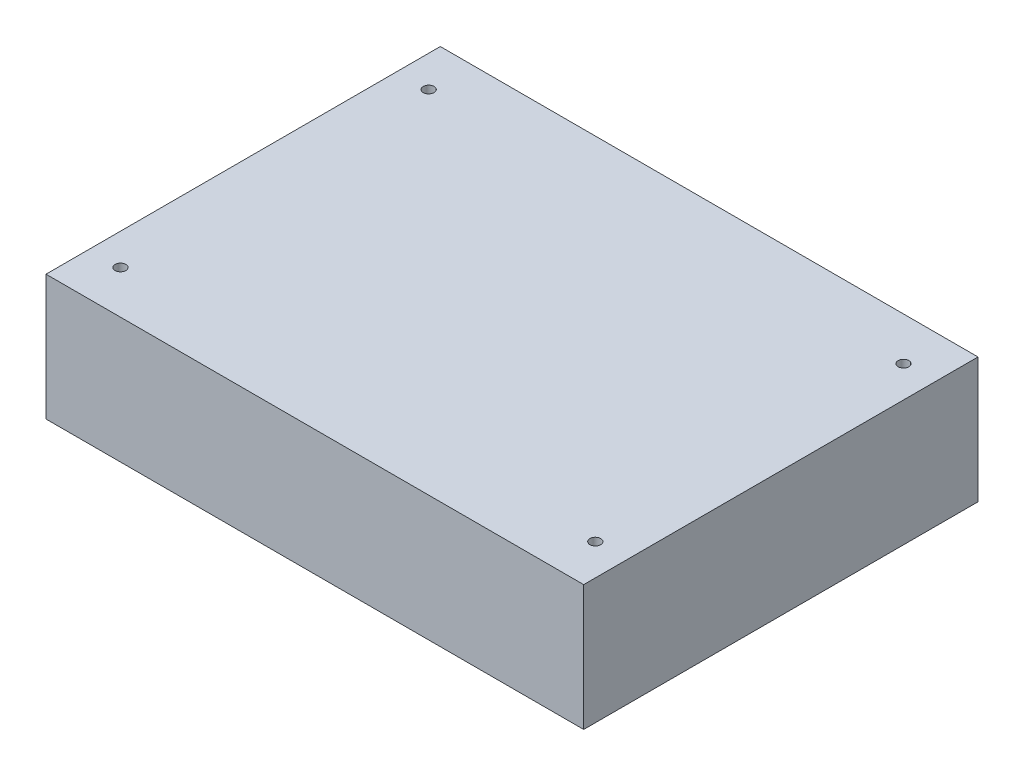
from build123d import *

# Parameters (mm, degrees)
SKETCH_1_W          = 150
SKETCH_1_H          = 110
EXTRUDE_1_DEPTH     = 35
SKETCH_2_R          = 1.5
CUT_EXTRUDE_1_DEPTH = 100.373034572


with BuildPart() as part:
    # Sketch 1 → Extrude 1 (new body)
    with BuildSketch(Plane(origin=(0, 0, 0), x_dir=(1, 0, 0), z_dir=(0, 1, 0))):
        Rectangle(SKETCH_1_W, SKETCH_1_H)
    extrude(amount=EXTRUDE_1_DEPTH)

    # Sketch 2 → Cut-Extrude 1 (cut, through all)
    with BuildSketch(Plane(origin=(0, 35, 0), x_dir=(1, 0, 0), z_dir=(0, 1, 0))):
        with Locations(Location((-66.2305, 42.9895, 0), (0, 0, 270))):
            Circle(SKETCH_2_R)
        with Locations(Location((-66.2305, -42.9895, 0), (0, 0, 270))):
            Circle(SKETCH_2_R)
        with Locations(Location((66.2305, -42.9895, 0), (0, 0, 270))):
            Circle(SKETCH_2_R)
        with Locations(Location((66.2305, 42.9895, 0), (0, 0, 270))):
            Circle(SKETCH_2_R)
    extrude(amount=-CUT_EXTRUDE_1_DEPTH, mode=Mode.SUBTRACT)


solid = part.part
